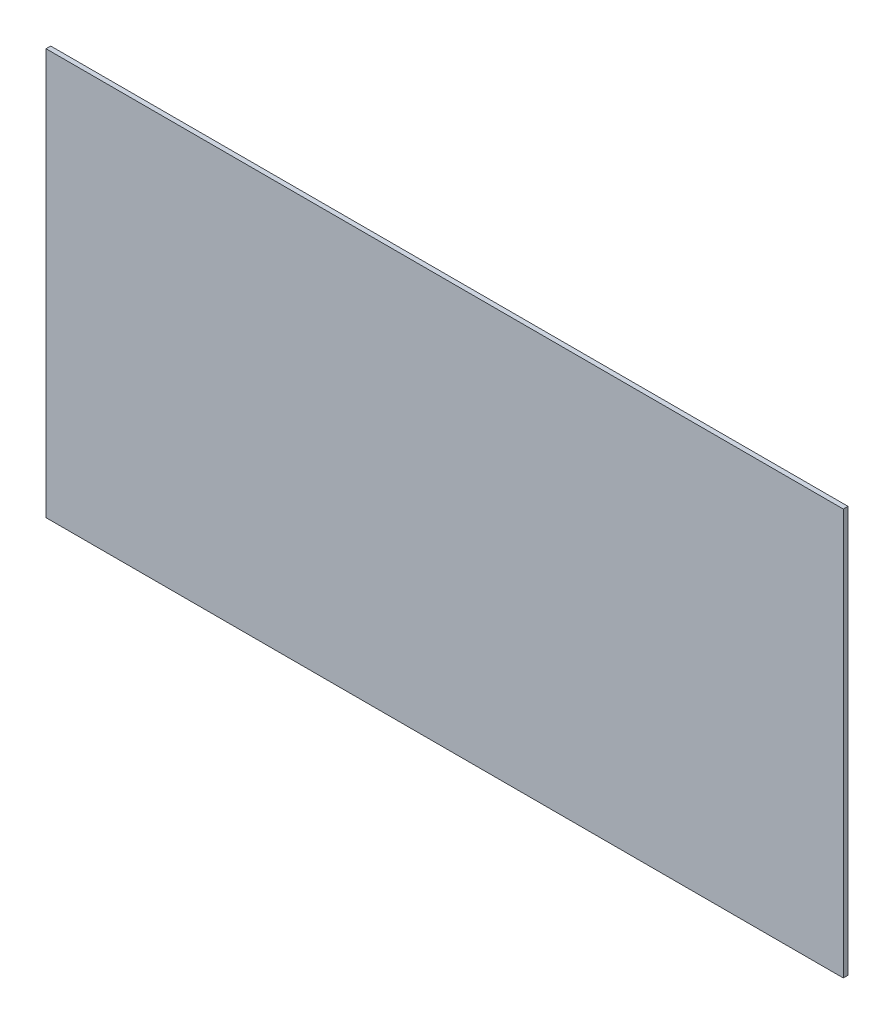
from build123d import *

# Parameters (mm, degrees)
ESQUISSE1_W        = 509.6
ESQUISSE1_H        = 259.6
BOSS_EXTRU_1_DEPTH = 3


with BuildPart() as part:
    # Esquisse1 → Boss.-Extru.1 (new body)
    with BuildSketch(Plane.XY):
        Rectangle(ESQUISSE1_W, ESQUISSE1_H)
    extrude(amount=BOSS_EXTRU_1_DEPTH)


solid = part.part
